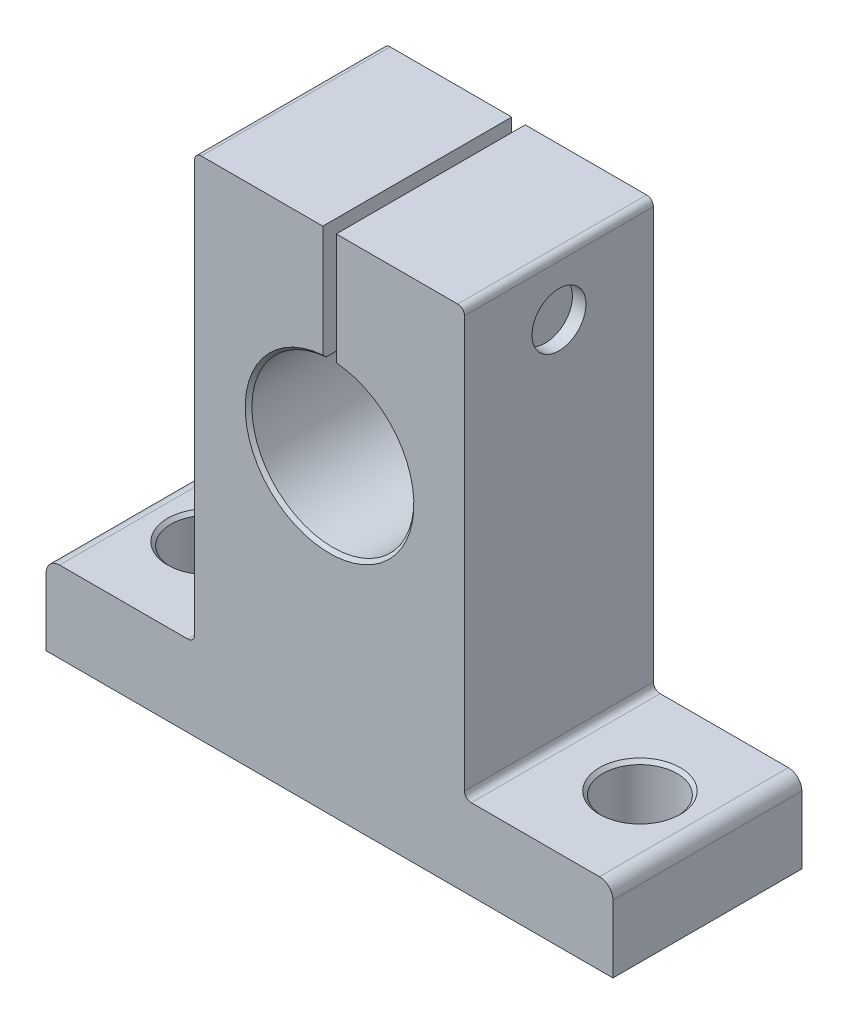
from build123d import *

# Parameters (mm, degrees)
BOSS_EXTRUDE1_DEPTH     = 14
CUT_EXTRUDE1_DEPTH      = 46.202322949
CUT_EXTRUDE1_DEPTH_BACK = 6
SKETCH3_R               = 2.75
FILLET1_R               = 1
FILLET2_R               = 0.5
CHAMFER1_SIZE           = 0.25
SKETCH4_R               = 3.1
CUT_EXTRUDE2_DEPTH      = 1
SKETCH5_R               = 3.1
SKETCH5_R_2             = 3
CUT_EXTRUDE3_DEPTH      = 4
CHAMFER2_SIZE           = 0.2
CUT_EXTRUDE4_DEPTH      = 2
SKETCH7_R               = 2
BOSS_EXTRUDE2_DEPTH     = 1
CUT_EXTRUDE5_START      = -1
SKETCH8_R               = 2
CUT_EXTRUDE5_DEPTH      = 1
SKETCH9_R               = 1.732050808
CUT_EXTRUDE6_DEPTH      = 1
CUT_EXTRUDE6_DRAFT      = -45


with BuildPart() as part:
    # Sketch1 → Boss-Extrude1 (new body)
    with BuildSketch(Plane.XY):
        with BuildLine():
            Line((-21, 0), (21, 0))
            Line((21, 0), (21, 6))
            Line((21, 6), (10, 6))
            Line((10, 6), (10, 37.5))
            Line((10, 37.5), (0.5, 37.5))
            Line((0.5, 37.5), (0.5, 28.979130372))
            ThreePointArc((0.5, 28.979130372), (0, 17), (-0.5, 28.979130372))
            Line((-0.5, 28.979130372), (-0.5, 37.5))
            Line((-0.5, 37.5), (-10, 37.5))
            Line((-10, 37.5), (-10, 6))
            Line((-10, 6), (-21, 6))
            Line((-21, 6), (-21, 0))
        make_face()
    extrude(amount=BOSS_EXTRUDE1_DEPTH)

    # Sketch3 → Cut-Extrude1 (cut, two sides: drawn at the far end of the back side and taken through both)
    with BuildSketch(Plane.XZ.offset(-CUT_EXTRUDE1_DEPTH_BACK)):
        with Locations(Location((-16, 7, 0), (0, 0, 180))):
            Circle(SKETCH3_R)
        with Locations(Location((16, 7, 0), (0, 0, 180))):
            Circle(SKETCH3_R)
    extrude(amount=CUT_EXTRUDE1_DEPTH + CUT_EXTRUDE1_DEPTH_BACK, mode=Mode.SUBTRACT)

    # Fillet1
    fillet1_edges = [part.edges().sort_by_distance(p)[0] for p in [
        (-21, 6, 7),
        (21, 6, 7),
    ]]
    fillet(fillet1_edges, radius=FILLET1_R)

    # Fillet2
    fillet2_edges = [part.edges().sort_by_distance(p)[0] for p in [
        (-10, 6, 7),
        (-10, 37.5, 7),
        (10, 37.5, 7),
        (10, 6, 7),
    ]]
    fillet(fillet2_edges, radius=FILLET2_R)

    # Chamfer1
    chamfer1_edges = [part.edges().sort_by_distance(p)[0] for p in [
        (0, 17, 0),
        (0, 17, 14),
        (18.75, 6, 7),
        (18.75, 0, 7),
        (-13.25, 6, 7),
        (-13.25, 0, 7),
    ]]
    chamfer(chamfer1_edges, length=CHAMFER1_SIZE)

    # Sketch4 → Cut-Extrude2 (cut)
    with BuildSketch(Plane.ZY.offset(10)):
        with Locations(Location((7, 33.25, 0), (0, 0, 270))):
            Circle(SKETCH4_R)
    extrude(amount=-CUT_EXTRUDE2_DEPTH, mode=Mode.SUBTRACT)

    # Sketch5 → Cut-Extrude3 (cut)
    with BuildSketch(Plane.ZY.offset(9)):
        with Locations(Location((7, 33.25, 0), (0, 0, 270))):
            Circle(SKETCH5_R)
        with Locations(Location((7, 33.25, 0), (0, 0, 270))):
            Circle(SKETCH5_R_2, mode=Mode.SUBTRACT)
    extrude(amount=-CUT_EXTRUDE3_DEPTH, mode=Mode.SUBTRACT)

    # Chamfer2
    chamfer2_edges = [part.edges().sort_by_distance(p)[0] for p in [
        (-9, 36.25, 7),
    ]]
    chamfer(chamfer2_edges, length=CHAMFER2_SIZE)

    # Sketch6 → Cut-Extrude4 (cut)
    with BuildSketch(Plane.ZY.offset(9)):
        Polygon((7.246062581, 31.535516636), (8.607817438, 32.605854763), (8.361754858, 34.320338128), (6.753937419, 34.964483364), (5.392182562, 33.894145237), (5.638245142, 32.179661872), align=None)
    extrude(amount=-CUT_EXTRUDE4_DEPTH, mode=Mode.SUBTRACT)

    # Sketch7 → Boss-Extrude2 (add)
    with BuildSketch(Plane(origin=(-0.5, 0, 0), x_dir=(0, 0, -1), z_dir=(1, 0, 0))):
        with Locations(Location((-7, 33.25, 0), (0, 0, 270))):
            Circle(SKETCH7_R)
    extrude(amount=BOSS_EXTRUDE2_DEPTH)

    # Sketch8 → Cut-Extrude5 (cut)
    with BuildSketch(Plane(origin=(10, 0, 0), x_dir=(0, 0, -1), z_dir=(1, 0, 0)).offset(CUT_EXTRUDE5_START)):
        with Locations(Location((-7, 33.25, 0), (0, 0, 270))):
            Circle(SKETCH8_R)
    extrude(amount=CUT_EXTRUDE5_DEPTH, mode=Mode.SUBTRACT)


with BuildPart() as cut_extrude6_tool:
    # Sketch9 → Cut-Extrude6 (with draft: the straight prism first)
    with BuildSketch(Plane.ZY.offset(9)):
        with Locations((7, 33.25)):
            Circle(SKETCH9_R)
    extrude(amount=-CUT_EXTRUDE6_DEPTH)
    # Cut-Extrude6: the draft: its side faces are tilted about the plane it starts from
    cut_extrude6_sides = [cut_extrude6_tool.faces().sort_by_distance(p)[0] for p in [
        (-8.5, 33.25, 5.267949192),
    ]]
    draft(cut_extrude6_sides, Plane.ZY.offset(9), CUT_EXTRUDE6_DRAFT)


with BuildPart() as part_1:
    add(part.part)

    # Cut-Extrude6: cut by cut_extrude6_tool
    add(cut_extrude6_tool.part, mode=Mode.SUBTRACT)


solid = part_1.part
